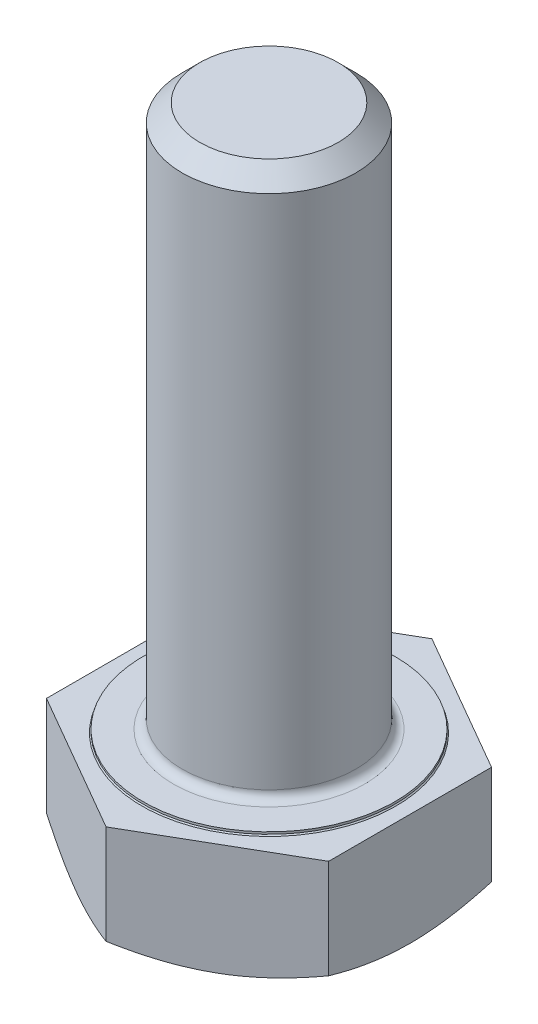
ISO-10303-21;
HEADER;
FILE_DESCRIPTION(('STEP AP214'),'2;1');
FILE_NAME('part.step','',(''),(''),'','','');
FILE_SCHEMA(('AUTOMOTIVE_DESIGN { 1 0 10303 214 1 1 1 1 }'));
ENDSEC;
DATA;
#1=APPLICATION_CONTEXT('core data for automotive mechanical design processes');
#2=APPLICATION_PROTOCOL_DEFINITION('international standard','automotive_design',2000,#1);
#3=PRODUCT_CONTEXT('',#1,'mechanical');
#4=PRODUCT('Part','Part','',(#3));
#5=PRODUCT_RELATED_PRODUCT_CATEGORY('part','',(#4));
#6=PRODUCT_DEFINITION_FORMATION('','',#4);
#7=PRODUCT_DEFINITION_CONTEXT('part definition',#1,'design');
#8=PRODUCT_DEFINITION('design','',#6,#7);
#9=PRODUCT_DEFINITION_SHAPE('','',#8);
#10=(LENGTH_UNIT() NAMED_UNIT(*) SI_UNIT(.MILLI.,.METRE.));
#11=(NAMED_UNIT(*) PLANE_ANGLE_UNIT() SI_UNIT($,.RADIAN.));
#12=(NAMED_UNIT(*) SI_UNIT($,.STERADIAN.) SOLID_ANGLE_UNIT());
#13=UNCERTAINTY_MEASURE_WITH_UNIT(LENGTH_MEASURE(1.E-05),#10,'distance_accuracy_value','');
#14=(GEOMETRIC_REPRESENTATION_CONTEXT(3) GLOBAL_UNCERTAINTY_ASSIGNED_CONTEXT((#13)) GLOBAL_UNIT_ASSIGNED_CONTEXT((#10,
#11,#12)) REPRESENTATION_CONTEXT('',''));
#15=CARTESIAN_POINT('',(0.,0.,0.));
#16=DIRECTION('',(0.,0.,1.));
#17=DIRECTION('',(1.,0.,0.));
#18=AXIS2_PLACEMENT_3D('',#15,#16,#17);
#19=CARTESIAN_POINT('',(0.,-5.3,0.));
#20=DIRECTION('',(0.,-1.,0.));
#21=DIRECTION('',(0.,0.,-1.));
#22=AXIS2_PLACEMENT_3D('',#19,#20,#21);
#23=PLANE('',#22);
#24=CARTESIAN_POINT('',(0.,-5.30000000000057,0.));
#25=DIRECTION('',(0.,1.,0.));
#26=DIRECTION('',(0.,0.,1.));
#27=AXIS2_PLACEMENT_3D('',#24,#25,#26);
#28=CIRCLE('',#27,6.50000000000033);
#29=CARTESIAN_POINT('',(-6.5,-5.30000000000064,2.32283677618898E-10));
#30=VERTEX_POINT('',#29);
#31=CARTESIAN_POINT('',(-3.25,-5.3000000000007,5.62916512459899));
#32=VERTEX_POINT('',#31);
#33=EDGE_CURVE('E174',#30,#32,#28,.T.);
#34=ORIENTED_EDGE('',*,*,#33,.F.);
#35=CARTESIAN_POINT('',(0.,-5.30000000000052,0.));
#36=DIRECTION('',(0.,1.,0.));
#37=DIRECTION('',(0.,0.,1.));
#38=AXIS2_PLACEMENT_3D('',#35,#36,#37);
#39=CIRCLE('',#38,6.50000000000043);
#40=CARTESIAN_POINT('',(-3.25000000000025,-5.30000000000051,-5.62916512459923));
#41=VERTEX_POINT('',#40);
#42=EDGE_CURVE('E59',#41,#30,#39,.T.);
#43=ORIENTED_EDGE('',*,*,#42,.F.);
#44=CARTESIAN_POINT('',(0.,-5.30000000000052,0.));
#45=DIRECTION('',(0.,1.,0.));
#46=DIRECTION('',(0.,0.,1.));
#47=AXIS2_PLACEMENT_3D('',#44,#45,#46);
#48=CIRCLE('',#47,6.50000000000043);
#49=CARTESIAN_POINT('',(3.25,-5.3000000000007,-5.62916512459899));
#50=VERTEX_POINT('',#49);
#51=EDGE_CURVE('E76',#50,#41,#48,.T.);
#52=ORIENTED_EDGE('',*,*,#51,.F.);
#53=CARTESIAN_POINT('',(0.,-5.30000000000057,0.));
#54=DIRECTION('',(0.,1.,0.));
#55=DIRECTION('',(0.,0.,1.));
#56=AXIS2_PLACEMENT_3D('',#53,#54,#55);
#57=CIRCLE('',#56,6.50000000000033);
#58=CARTESIAN_POINT('',(6.50000000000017,-5.30000000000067,-1.74207154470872E-10));
#59=VERTEX_POINT('',#58);
#60=EDGE_CURVE('E74',#59,#50,#57,.T.);
#61=ORIENTED_EDGE('',*,*,#60,.F.);
#62=CARTESIAN_POINT('',(0.,-5.30000000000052,0.));
#63=DIRECTION('',(0.,1.,0.));
#64=DIRECTION('',(0.,0.,1.));
#65=AXIS2_PLACEMENT_3D('',#62,#63,#64);
#66=CIRCLE('',#65,6.50000000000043);
#67=CARTESIAN_POINT('',(3.25000000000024,-5.30000000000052,5.62916512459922));
#68=VERTEX_POINT('',#67);
#69=EDGE_CURVE('E175',#68,#59,#66,.T.);
#70=ORIENTED_EDGE('',*,*,#69,.F.);
#71=CARTESIAN_POINT('',(0.,-5.30000000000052,0.));
#72=DIRECTION('',(0.,1.,0.));
#73=DIRECTION('',(0.,0.,1.));
#74=AXIS2_PLACEMENT_3D('',#71,#72,#73);
#75=CIRCLE('',#74,6.50000000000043);
#76=EDGE_CURVE('E170',#32,#68,#75,.T.);
#77=ORIENTED_EDGE('',*,*,#76,.F.);
#78=EDGE_LOOP('',(#34,#43,#52,#61,#70,#77));
#79=FACE_BOUND('',#78,.T.);
#80=ADVANCED_FACE('F42',(#79),#23,.T.);
#81=CARTESIAN_POINT('',(0.,-4.71596007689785,0.));
#82=DIRECTION('',(0.,1.,0.));
#83=DIRECTION('',(0.,0.,1.));
#84=AXIS2_PLACEMENT_3D('',#81,#82,#83);
#85=CONICAL_SURFACE('',#84,7.51158682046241,1.0471975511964);
#86=CARTESIAN_POINT('',(6.4999999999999,-4.71944341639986,-3.75277674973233));
#87=CARTESIAN_POINT('',(6.23545138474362,-4.80764841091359,-3.90551396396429));
#88=CARTESIAN_POINT('',(5.96878416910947,-4.88845958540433,-4.05947435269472));
#89=CARTESIAN_POINT('',(5.43309909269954,-5.0309686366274,-4.36875227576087));
#90=CARTESIAN_POINT('',(5.16409991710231,-5.09276102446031,-4.52405902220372));
#91=CARTESIAN_POINT('',(4.75806245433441,-5.16863158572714,-4.75848486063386));
#92=CARTESIAN_POINT('',(4.62220372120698,-5.1911279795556,-4.83692293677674));
#93=CARTESIAN_POINT('',(4.34983584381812,-5.23006970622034,-4.99417460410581));
#94=CARTESIAN_POINT('',(4.21332671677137,-5.24651519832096,-5.0729881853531));
#95=CARTESIAN_POINT('',(3.93915312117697,-5.27306617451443,-5.23128238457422));
#96=CARTESIAN_POINT('',(3.80148629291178,-5.28313941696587,-5.31076436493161));
#97=CARTESIAN_POINT('',(3.52588189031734,-5.29662027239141,-5.46988464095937));
#98=CARTESIAN_POINT('',(3.38794426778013,-5.30002656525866,-5.54952296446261));
#99=CARTESIAN_POINT('',(3.24999999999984,-5.30000000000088,-5.62916512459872));
#100=B_SPLINE_CURVE_WITH_KNOTS('',3,(#86,#87,#88,#89,#90,#91,#92,#93,#94,#95,#96,#97,#98,#99),
.UNSPECIFIED.,.F.,.F.,(4,2,2,2,2,2,4),(0.,0.954247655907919,1.90367376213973,2.37900973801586,
2.85433320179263,3.3320428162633,3.80984701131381),.UNSPECIFIED.);
#101=CARTESIAN_POINT('',(6.5,-4.71944341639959,-3.752776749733));
#102=VERTEX_POINT('',#101);
#103=EDGE_CURVE('E159',#102,#50,#100,.T.);
#104=ORIENTED_EDGE('',*,*,#103,.F.);
#105=CARTESIAN_POINT('',(6.5,-5.30000000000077,-3.48414706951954E-10));
#106=CARTESIAN_POINT('',(6.5,-5.30002656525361,-0.159284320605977));
#107=CARTESIAN_POINT('',(6.5,-5.29662027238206,-0.318560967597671));
#108=CARTESIAN_POINT('',(6.5,-5.28313941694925,-0.636801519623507));
#109=CARTESIAN_POINT('',(6.5,-5.27306617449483,-0.795765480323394));
#110=CARTESIAN_POINT('',(6.5,-5.24651519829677,-1.11235387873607));
#111=CARTESIAN_POINT('',(6.5,-5.23006970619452,-1.26998104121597));
#112=CARTESIAN_POINT('',(6.5,-5.19112797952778,-1.58448437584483));
#113=CARTESIAN_POINT('',(6.5,-5.16863158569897,-1.74136052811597));
#114=CARTESIAN_POINT('',(6.5,-5.09276102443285,-2.2102122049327));
#115=CARTESIAN_POINT('',(6.5,-5.0309686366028,-2.52082569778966));
#116=CARTESIAN_POINT('',(6.5,-4.88845958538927,-3.13938154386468));
#117=CARTESIAN_POINT('',(6.5,-4.80764841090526,-3.44730232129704));
#118=CARTESIAN_POINT('',(6.5,-4.71944341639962,-3.75277674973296));
#119=B_SPLINE_CURVE_WITH_KNOTS('',3,(#105,#106,#107,#108,#109,#110,#111,#112,#113,#114,#115,
#116,#117,#118),.UNSPECIFIED.,.F.,.F.,(4,2,2,2,2,2,4),(0.,0.477804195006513,0.955513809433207,
1.43083727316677,1.90617324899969,2.85559935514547,3.80984701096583),.UNSPECIFIED.);
#120=EDGE_CURVE('E309',#59,#102,#119,.T.);
#121=ORIENTED_EDGE('',*,*,#120,.F.);
#122=ORIENTED_EDGE('',*,*,#60,.T.);
#123=EDGE_LOOP('',(#104,#121,#122));
#124=FACE_BOUND('',#123,.T.);
#125=ADVANCED_FACE('F315',(#124),#85,.T.);
#126=CARTESIAN_POINT('',(0.,-4.71596007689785,0.));
#127=DIRECTION('',(0.,1.,0.));
#128=DIRECTION('',(0.,0.,1.));
#129=AXIS2_PLACEMENT_3D('',#126,#127,#128);
#130=CONICAL_SURFACE('',#129,7.51158682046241,1.0471975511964);
#131=CARTESIAN_POINT('',(6.5,-4.71944341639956,3.75277674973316));
#132=CARTESIAN_POINT('',(6.5,-4.80764841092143,3.4473023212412));
#133=CARTESIAN_POINT('',(6.5,-4.88845958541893,3.13938154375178));
#134=CARTESIAN_POINT('',(6.5,-5.03096863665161,2.52082569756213));
#135=CARTESIAN_POINT('',(6.5,-5.0927610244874,2.21021220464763));
#136=CARTESIAN_POINT('',(6.5,-5.16863158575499,1.74136052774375));
#137=CARTESIAN_POINT('',(6.5,-5.1911279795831,1.58448437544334));
#138=CARTESIAN_POINT('',(6.5,-5.23006970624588,1.26998104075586));
#139=CARTESIAN_POINT('',(6.5,-5.24651519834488,1.11235387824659));
#140=CARTESIAN_POINT('',(6.5,-5.27306617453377,0.795765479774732));
#141=CARTESIAN_POINT('',(6.5,-5.28313941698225,0.63680151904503));
#142=CARTESIAN_POINT('',(6.5,-5.29662027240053,0.318560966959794));
#143=CARTESIAN_POINT('',(6.5,-5.3000265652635,0.159284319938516));
#144=CARTESIAN_POINT('',(6.5,-5.30000000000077,-3.48414775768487E-10));
#145=B_SPLINE_CURVE_WITH_KNOTS('',3,(#131,#132,#133,#134,#135,#136,#137,#138,#139,#140,#141,
#142,#143,#144),.UNSPECIFIED.,.F.,.F.,(4,2,2,2,2,2,4),(0.,0.954247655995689,1.90367376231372,
2.37900973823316,2.85433320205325,3.332042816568,3.80984701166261),.UNSPECIFIED.);
#146=CARTESIAN_POINT('',(6.5,-4.71944341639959,3.752776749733));
#147=VERTEX_POINT('',#146);
#148=EDGE_CURVE('E269',#147,#59,#145,.T.);
#149=ORIENTED_EDGE('',*,*,#148,.F.);
#150=CARTESIAN_POINT('',(3.25000000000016,-5.30000000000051,5.62916512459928));
#151=CARTESIAN_POINT('',(3.38794426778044,-5.3000265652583,5.54952296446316));
#152=CARTESIAN_POINT('',(3.52588189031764,-5.29662027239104,5.46988464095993));
#153=CARTESIAN_POINT('',(3.80148629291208,-5.28313941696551,5.31076436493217));
#154=CARTESIAN_POINT('',(3.93915312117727,-5.27306617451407,5.23128238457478));
#155=CARTESIAN_POINT('',(4.21332671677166,-5.2465151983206,5.07298818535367));
#156=CARTESIAN_POINT('',(4.34983584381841,-5.23006970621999,4.99417460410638));
#157=CARTESIAN_POINT('',(4.62220372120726,-5.19112797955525,4.83692293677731));
#158=CARTESIAN_POINT('',(4.75806245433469,-5.16863158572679,4.75848486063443));
#159=CARTESIAN_POINT('',(5.16409991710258,-5.09276102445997,4.5240590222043));
#160=CARTESIAN_POINT('',(5.43309909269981,-5.03096863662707,4.36875227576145));
#161=CARTESIAN_POINT('',(5.96878416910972,-4.88845958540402,4.05947435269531));
#162=CARTESIAN_POINT('',(6.23545138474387,-4.80764841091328,3.90551396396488));
#163=CARTESIAN_POINT('',(6.50000000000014,-4.71944341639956,3.75277674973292));
#164=B_SPLINE_CURVE_WITH_KNOTS('',3,(#150,#151,#152,#153,#154,#155,#156,#157,#158,#159,#160,
#161,#162,#163),.UNSPECIFIED.,.F.,.F.,(4,2,2,2,2,2,4),(0.,0.477804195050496,0.955513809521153,
1.43083727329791,1.90617324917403,2.85559935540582,3.80984701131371),.UNSPECIFIED.);
#165=EDGE_CURVE('E244',#68,#147,#164,.T.);
#166=ORIENTED_EDGE('',*,*,#165,.F.);
#167=ORIENTED_EDGE('',*,*,#69,.T.);
#168=EDGE_LOOP('',(#149,#166,#167));
#169=FACE_BOUND('',#168,.T.);
#170=ADVANCED_FACE('F277',(#169),#130,.T.);
#171=CARTESIAN_POINT('',(0.,-4.715960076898,0.));
#172=DIRECTION('',(0.,1.,0.));
#173=DIRECTION('',(0.,0.,1.));
#174=AXIS2_PLACEMENT_3D('',#171,#172,#173);
#175=CONICAL_SURFACE('',#174,7.51158682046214,1.0471975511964);
#176=CARTESIAN_POINT('',(1.59653095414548E-13,-4.71944341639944,7.50555349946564));
#177=CARTESIAN_POINT('',(0.264548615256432,-4.80764841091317,7.35281628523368));
#178=CARTESIAN_POINT('',(0.531215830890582,-4.88845958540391,7.19885589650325));
#179=CARTESIAN_POINT('',(1.0669009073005,-5.03096863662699,6.88957797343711));
#180=CARTESIAN_POINT('',(1.33590008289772,-5.09276102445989,6.73427122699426));
#181=CARTESIAN_POINT('',(1.74193754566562,-5.16863158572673,6.49984538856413));
#182=CARTESIAN_POINT('',(1.87779627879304,-5.19112797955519,6.42140731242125));
#183=CARTESIAN_POINT('',(2.1501641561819,-5.23006970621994,6.26415564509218));
#184=CARTESIAN_POINT('',(2.28667328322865,-5.24651519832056,6.18534206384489));
#185=CARTESIAN_POINT('',(2.56084687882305,-5.27306617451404,6.02704786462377));
#186=CARTESIAN_POINT('',(2.69851370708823,-5.28313941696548,5.94756588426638));
#187=CARTESIAN_POINT('',(2.97411810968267,-5.29662027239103,5.78844560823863));
#188=CARTESIAN_POINT('',(3.11205573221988,-5.30002656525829,5.70880728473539));
#189=CARTESIAN_POINT('',(3.25000000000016,-5.30000000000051,5.62916512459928));
#190=B_SPLINE_CURVE_WITH_KNOTS('',3,(#176,#177,#178,#179,#180,#181,#182,#183,#184,#185,#186,
#187,#188,#189),.UNSPECIFIED.,.F.,.F.,(4,2,2,2,2,2,4),(0.,0.954247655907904,1.9036737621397,
2.37900973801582,2.85433320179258,3.33204281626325,3.80984701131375),.UNSPECIFIED.);
#191=CARTESIAN_POINT('',(3.05528172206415E-13,-4.71944341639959,7.50555349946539));
#192=VERTEX_POINT('',#191);
#193=EDGE_CURVE('E287',#192,#68,#190,.T.);
#194=ORIENTED_EDGE('',*,*,#193,.F.);
#195=CARTESIAN_POINT('',(-3.24999999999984,-5.30000000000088,5.62916512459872));
#196=CARTESIAN_POINT('',(-3.11205573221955,-5.30002656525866,5.70880728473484));
#197=CARTESIAN_POINT('',(-2.97411810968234,-5.2966202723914,5.78844560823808));
#198=CARTESIAN_POINT('',(-2.69851370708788,-5.28313941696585,5.94756588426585));
#199=CARTESIAN_POINT('',(-2.56084687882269,-5.2730661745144,6.02704786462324));
#200=CARTESIAN_POINT('',(-2.28667328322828,-5.24651519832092,6.18534206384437));
#201=CARTESIAN_POINT('',(-2.15016415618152,-5.23006970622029,6.26415564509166));
#202=CARTESIAN_POINT('',(-1.87779627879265,-5.19112797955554,6.42140731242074));
#203=CARTESIAN_POINT('',(-1.74193754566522,-5.16863158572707,6.49984538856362));
#204=CARTESIAN_POINT('',(-1.33590008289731,-5.09276102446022,6.73427122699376));
#205=CARTESIAN_POINT('',(-1.06690090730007,-5.0309686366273,6.88957797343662));
#206=CARTESIAN_POINT('',(-0.531215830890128,-4.8884595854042,7.19885589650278));
#207=CARTESIAN_POINT('',(-0.264548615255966,-4.80764841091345,7.35281628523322));
#208=CARTESIAN_POINT('',(3.19718971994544E-13,-4.71944341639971,7.50555349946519));
#209=B_SPLINE_CURVE_WITH_KNOTS('',3,(#195,#196,#197,#198,#199,#200,#201,#202,#203,#204,#205,
#206,#207,#208),.UNSPECIFIED.,.F.,.F.,(4,2,2,2,2,2,4),(0.,0.477804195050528,0.955513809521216,
1.43083727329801,1.90617324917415,2.855599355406,3.80984701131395),.UNSPECIFIED.);
#210=EDGE_CURVE('E243',#32,#192,#209,.T.);
#211=ORIENTED_EDGE('',*,*,#210,.F.);
#212=ORIENTED_EDGE('',*,*,#76,.T.);
#213=EDGE_LOOP('',(#194,#211,#212));
#214=FACE_BOUND('',#213,.T.);
#215=ADVANCED_FACE('F273',(#214),#175,.T.);
#216=CARTESIAN_POINT('',(0.,-4.71596007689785,0.));
#217=DIRECTION('',(0.,1.,0.));
#218=DIRECTION('',(0.,0.,1.));
#219=AXIS2_PLACEMENT_3D('',#216,#217,#218);
#220=CONICAL_SURFACE('',#219,7.51158682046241,1.0471975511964);
#221=CARTESIAN_POINT('',(-6.4999999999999,-4.71944341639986,3.75277674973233));
#222=CARTESIAN_POINT('',(-6.23545138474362,-4.80764841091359,3.90551396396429));
#223=CARTESIAN_POINT('',(-5.96878416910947,-4.88845958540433,4.05947435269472));
#224=CARTESIAN_POINT('',(-5.43309909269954,-5.0309686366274,4.36875227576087));
#225=CARTESIAN_POINT('',(-5.16409991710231,-5.09276102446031,4.52405902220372));
#226=CARTESIAN_POINT('',(-4.75806245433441,-5.16863158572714,4.75848486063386));
#227=CARTESIAN_POINT('',(-4.62220372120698,-5.1911279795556,4.83692293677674));
#228=CARTESIAN_POINT('',(-4.34983584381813,-5.23006970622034,4.99417460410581));
#229=CARTESIAN_POINT('',(-4.21332671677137,-5.24651519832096,5.0729881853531));
#230=CARTESIAN_POINT('',(-3.93915312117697,-5.27306617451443,5.23128238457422));
#231=CARTESIAN_POINT('',(-3.80148629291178,-5.28313941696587,5.31076436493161));
#232=CARTESIAN_POINT('',(-3.52588189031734,-5.29662027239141,5.46988464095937));
#233=CARTESIAN_POINT('',(-3.38794426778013,-5.30002656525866,5.54952296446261));
#234=CARTESIAN_POINT('',(-3.24999999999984,-5.30000000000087,5.62916512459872));
#235=B_SPLINE_CURVE_WITH_KNOTS('',3,(#221,#222,#223,#224,#225,#226,#227,#228,#229,#230,#231,
#232,#233,#234),.UNSPECIFIED.,.F.,.F.,(4,2,2,2,2,2,4),(0.,0.954247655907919,1.90367376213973,
2.37900973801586,2.85433320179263,3.3320428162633,3.80984701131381),.UNSPECIFIED.);
#236=CARTESIAN_POINT('',(-6.4999999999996,-4.71944341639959,3.75277674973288));
#237=VERTEX_POINT('',#236);
#238=EDGE_CURVE('E239',#237,#32,#235,.T.);
#239=ORIENTED_EDGE('',*,*,#238,.F.);
#240=CARTESIAN_POINT('',(-6.5,-5.30000000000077,4.64567355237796E-10));
#241=CARTESIAN_POINT('',(-6.5,-5.30002656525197,0.159284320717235));
#242=CARTESIAN_POINT('',(-6.5,-5.29662027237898,0.318560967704));
#243=CARTESIAN_POINT('',(-6.5,-5.28313941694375,0.636801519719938));
#244=CARTESIAN_POINT('',(-6.5,-5.27306617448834,0.795765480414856));
#245=CARTESIAN_POINT('',(-6.5,-5.24651519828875,1.11235387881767));
#246=CARTESIAN_POINT('',(-6.5,-5.23006970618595,1.26998104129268));
#247=CARTESIAN_POINT('',(-6.5,-5.19112797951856,1.58448437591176));
#248=CARTESIAN_POINT('',(-6.5,-5.16863158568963,1.74136052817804));
#249=CARTESIAN_POINT('',(-6.5,-5.09276102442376,2.21021220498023));
#250=CARTESIAN_POINT('',(-6.5,-5.03096863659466,2.5208256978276));
#251=CARTESIAN_POINT('',(-6.5,-4.88845958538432,3.13938154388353));
#252=CARTESIAN_POINT('',(-6.5,-4.80764841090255,3.44730232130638));
#253=CARTESIAN_POINT('',(-6.5,-4.71944341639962,3.75277674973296));
#254=B_SPLINE_CURVE_WITH_KNOTS('',3,(#240,#241,#242,#243,#244,#245,#246,#247,#248,#249,#250,
#251,#252,#253),.UNSPECIFIED.,.F.,.F.,(4,2,2,2,2,2,4),(0.,0.477804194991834,0.955513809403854,
1.430837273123,1.9061732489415,2.85559935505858,3.80984701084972),.UNSPECIFIED.);
#255=EDGE_CURVE('E250',#30,#237,#254,.T.);
#256=ORIENTED_EDGE('',*,*,#255,.F.);
#257=ORIENTED_EDGE('',*,*,#33,.T.);
#258=EDGE_LOOP('',(#239,#256,#257));
#259=FACE_BOUND('',#258,.T.);
#260=ADVANCED_FACE('F207',(#259),#220,.T.);
#261=CARTESIAN_POINT('',(0.,-4.715960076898,0.));
#262=DIRECTION('',(0.,1.,0.));
#263=DIRECTION('',(0.,0.,1.));
#264=AXIS2_PLACEMENT_3D('',#261,#262,#263);
#265=CONICAL_SURFACE('',#264,7.51158682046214,1.0471975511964);
#266=CARTESIAN_POINT('',(-2.03471728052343E-13,-4.71944341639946,-7.50555349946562));
#267=CARTESIAN_POINT('',(-0.264548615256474,-4.80764841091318,-7.35281628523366));
#268=CARTESIAN_POINT('',(-0.53121583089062,-4.88845958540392,-7.19885589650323));
#269=CARTESIAN_POINT('',(-1.06690090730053,-5.03096863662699,-6.88957797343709));
#270=CARTESIAN_POINT('',(-1.33590008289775,-5.0927610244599,-6.73427122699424));
#271=CARTESIAN_POINT('',(-1.74193754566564,-5.16863158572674,-6.49984538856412));
#272=CARTESIAN_POINT('',(-1.87779627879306,-5.19112797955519,-6.42140731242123));
#273=CARTESIAN_POINT('',(-2.15016415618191,-5.23006970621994,-6.26415564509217));
#274=CARTESIAN_POINT('',(-2.28667328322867,-5.24651519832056,-6.18534206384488));
#275=CARTESIAN_POINT('',(-2.56084687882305,-5.27306617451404,-6.02704786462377));
#276=CARTESIAN_POINT('',(-2.69851370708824,-5.28313941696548,-5.94756588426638));
#277=CARTESIAN_POINT('',(-2.97411810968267,-5.29662027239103,-5.78844560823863));
#278=CARTESIAN_POINT('',(-3.11205573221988,-5.30002656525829,-5.70880728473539));
#279=CARTESIAN_POINT('',(-3.25000000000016,-5.30000000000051,-5.62916512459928));
#280=B_SPLINE_CURVE_WITH_KNOTS('',3,(#266,#267,#268,#269,#270,#271,#272,#273,#274,#275,#276,
#277,#278,#279),.UNSPECIFIED.,.F.,.F.,(4,2,2,2,2,2,4),(0.,0.954247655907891,1.90367376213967,
2.37900973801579,2.85433320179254,3.3320428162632,3.80984701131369),.UNSPECIFIED.);
#281=CARTESIAN_POINT('',(2.4611389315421E-13,-4.71944341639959,-7.50555349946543));
#282=VERTEX_POINT('',#281);
#283=EDGE_CURVE('E196',#282,#41,#280,.T.);
#284=ORIENTED_EDGE('',*,*,#283,.F.);
#285=CARTESIAN_POINT('',(3.24999999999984,-5.30000000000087,-5.62916512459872));
#286=CARTESIAN_POINT('',(3.11205573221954,-5.30002656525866,-5.70880728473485));
#287=CARTESIAN_POINT('',(2.97411810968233,-5.2966202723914,-5.78844560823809));
#288=CARTESIAN_POINT('',(2.69851370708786,-5.28313941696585,-5.94756588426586));
#289=CARTESIAN_POINT('',(2.56084687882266,-5.2730661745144,-6.02704786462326));
#290=CARTESIAN_POINT('',(2.28667328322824,-5.24651519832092,-6.18534206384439));
#291=CARTESIAN_POINT('',(2.15016415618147,-5.23006970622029,-6.26415564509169));
#292=CARTESIAN_POINT('',(1.8777962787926,-5.19112797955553,-6.42140731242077));
#293=CARTESIAN_POINT('',(1.74193754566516,-5.16863158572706,-6.49984538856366));
#294=CARTESIAN_POINT('',(1.33590008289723,-5.0927610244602,-6.73427122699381));
#295=CARTESIAN_POINT('',(1.06690090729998,-5.03096863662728,-6.88957797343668));
#296=CARTESIAN_POINT('',(0.531215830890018,-4.88845958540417,-7.19885589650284));
#297=CARTESIAN_POINT('',(0.264548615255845,-4.80764841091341,-7.35281628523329));
#298=CARTESIAN_POINT('',(-4.51011908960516E-13,-4.71944341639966,-7.50555349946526));
#299=B_SPLINE_CURVE_WITH_KNOTS('',3,(#285,#286,#287,#288,#289,#290,#291,#292,#293,#294,#295,
#296,#297,#298),.UNSPECIFIED.,.F.,.F.,(4,2,2,2,2,2,4),(0.,0.477804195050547,0.955513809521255,
1.43083727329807,1.90617324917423,2.85559935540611,3.80984701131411),.UNSPECIFIED.);
#300=EDGE_CURVE('E144',#50,#282,#299,.T.);
#301=ORIENTED_EDGE('',*,*,#300,.F.);
#302=ORIENTED_EDGE('',*,*,#51,.T.);
#303=EDGE_LOOP('',(#284,#301,#302));
#304=FACE_BOUND('',#303,.T.);
#305=ADVANCED_FACE('F202',(#304),#265,.T.);
#306=CARTESIAN_POINT('',(0.,-4.71596007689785,0.));
#307=DIRECTION('',(0.,1.,0.));
#308=DIRECTION('',(0.,0.,1.));
#309=AXIS2_PLACEMENT_3D('',#306,#307,#308);
#310=CONICAL_SURFACE('',#309,7.51158682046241,1.0471975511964);
#311=CARTESIAN_POINT('',(-6.5,-4.71944341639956,-3.75277674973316));
#312=CARTESIAN_POINT('',(-6.5,-4.80764841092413,-3.44730232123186));
#313=CARTESIAN_POINT('',(-6.5,-4.88845958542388,-3.13938154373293));
#314=CARTESIAN_POINT('',(-6.5,-5.03096863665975,-2.52082569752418));
#315=CARTESIAN_POINT('',(-6.5,-5.09276102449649,-2.21021220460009));
#316=CARTESIAN_POINT('',(-6.5,-5.16863158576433,-1.74136052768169));
#317=CARTESIAN_POINT('',(-6.5,-5.19112797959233,-1.5844843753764));
#318=CARTESIAN_POINT('',(-6.5,-5.23006970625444,-1.26998104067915));
#319=CARTESIAN_POINT('',(-6.5,-5.2465151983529,-1.11235387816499));
#320=CARTESIAN_POINT('',(-6.5,-5.27306617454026,-0.79576547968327));
#321=CARTESIAN_POINT('',(-6.5,-5.28313941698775,-0.6368015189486));
#322=CARTESIAN_POINT('',(-6.5,-5.29662027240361,-0.318560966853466));
#323=CARTESIAN_POINT('',(-6.5,-5.30002656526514,-0.159284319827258));
#324=CARTESIAN_POINT('',(-6.5,-5.30000000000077,4.64566660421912E-10));
#325=B_SPLINE_CURVE_WITH_KNOTS('',3,(#311,#312,#313,#314,#315,#316,#317,#318,#319,#320,#321,
#322,#323,#324),.UNSPECIFIED.,.F.,.F.,(4,2,2,2,2,2,4),(0.,0.954247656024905,1.90367376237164,
2.3790097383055,2.85433320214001,3.33204281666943,3.80984701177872),.UNSPECIFIED.);
#326=CARTESIAN_POINT('',(-6.5,-4.71944341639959,-3.752776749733));
#327=VERTEX_POINT('',#326);
#328=EDGE_CURVE('E219',#327,#30,#325,.T.);
#329=ORIENTED_EDGE('',*,*,#328,.F.);
#330=CARTESIAN_POINT('',(-3.25000000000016,-5.30000000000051,-5.62916512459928));
#331=CARTESIAN_POINT('',(-3.38794426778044,-5.3000265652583,-5.54952296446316));
#332=CARTESIAN_POINT('',(-3.52588189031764,-5.29662027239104,-5.46988464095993));
#333=CARTESIAN_POINT('',(-3.80148629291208,-5.28313941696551,-5.31076436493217));
#334=CARTESIAN_POINT('',(-3.93915312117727,-5.27306617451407,-5.23128238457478));
#335=CARTESIAN_POINT('',(-4.21332671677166,-5.2465151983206,-5.07298818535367));
#336=CARTESIAN_POINT('',(-4.34983584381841,-5.23006970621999,-4.99417460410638));
#337=CARTESIAN_POINT('',(-4.62220372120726,-5.19112797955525,-4.83692293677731));
#338=CARTESIAN_POINT('',(-4.75806245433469,-5.16863158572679,-4.75848486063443));
#339=CARTESIAN_POINT('',(-5.16409991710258,-5.09276102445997,-4.5240590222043));
#340=CARTESIAN_POINT('',(-5.43309909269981,-5.03096863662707,-4.36875227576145));
#341=CARTESIAN_POINT('',(-5.96878416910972,-4.88845958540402,-4.05947435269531));
#342=CARTESIAN_POINT('',(-6.23545138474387,-4.80764841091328,-3.90551396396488));
#343=CARTESIAN_POINT('',(-6.50000000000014,-4.71944341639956,-3.75277674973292));
#344=B_SPLINE_CURVE_WITH_KNOTS('',3,(#330,#331,#332,#333,#334,#335,#336,#337,#338,#339,#340,
#341,#342,#343),.UNSPECIFIED.,.F.,.F.,(4,2,2,2,2,2,4),(0.,0.477804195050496,0.955513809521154,
1.43083727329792,1.90617324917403,2.85559935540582,3.80984701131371),.UNSPECIFIED.);
#345=EDGE_CURVE('E238',#41,#327,#344,.T.);
#346=ORIENTED_EDGE('',*,*,#345,.F.);
#347=ORIENTED_EDGE('',*,*,#42,.T.);
#348=EDGE_LOOP('',(#329,#346,#347));
#349=FACE_BOUND('',#348,.T.);
#350=ADVANCED_FACE('F206',(#349),#310,.T.);
#351=CARTESIAN_POINT('',(0.,0.,-7.505553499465));
#352=DIRECTION('',(0.500000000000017,0.,-0.866025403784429));
#353=DIRECTION('',(-0.866025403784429,0.,-0.500000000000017));
#354=AXIS2_PLACEMENT_3D('',#351,#352,#353);
#355=PLANE('',#354);
#356=ORIENTED_EDGE('',*,*,#300,.T.);
#357=DIRECTION('',(0.,-1.,0.));
#358=VECTOR('',#357,1.);
#359=CARTESIAN_POINT('',(2.4611389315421E-13,-0.15,-7.50555349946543));
#360=LINE('',#359,#358);
#361=CARTESIAN_POINT('',(2.4611389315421E-13,-0.15,-7.50555349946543));
#362=VERTEX_POINT('',#361);
#363=EDGE_CURVE('E140',#362,#282,#360,.T.);
#364=ORIENTED_EDGE('',*,*,#363,.F.);
#365=DIRECTION('',(-0.866025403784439,0.,-0.5));
#366=VECTOR('',#365,1.);
#367=CARTESIAN_POINT('',(2.4611389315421E-13,-0.15,-7.50555349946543));
#368=LINE('',#367,#366);
#369=CARTESIAN_POINT('',(6.5,-0.15,-3.752776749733));
#370=VERTEX_POINT('',#369);
#371=EDGE_CURVE('E129',#370,#362,#368,.T.);
#372=ORIENTED_EDGE('',*,*,#371,.F.);
#373=DIRECTION('',(0.,-1.,0.));
#374=VECTOR('',#373,1.);
#375=CARTESIAN_POINT('',(6.5,-0.15,-3.752776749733));
#376=LINE('',#375,#374);
#377=EDGE_CURVE('E148',#370,#102,#376,.T.);
#378=ORIENTED_EDGE('',*,*,#377,.T.);
#379=ORIENTED_EDGE('',*,*,#103,.T.);
#380=EDGE_LOOP('',(#356,#364,#372,#378,#379));
#381=FACE_BOUND('',#380,.T.);
#382=ADVANCED_FACE('F141',(#381),#355,.T.);
#383=CARTESIAN_POINT('',(6.5,0.,-3.752776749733));
#384=DIRECTION('',(1.,0.,0.));
#385=DIRECTION('',(0.,0.,-1.));
#386=AXIS2_PLACEMENT_3D('',#383,#384,#385);
#387=PLANE('',#386);
#388=ORIENTED_EDGE('',*,*,#120,.T.);
#389=ORIENTED_EDGE('',*,*,#377,.F.);
#390=DIRECTION('',(0.,0.,-1.));
#391=VECTOR('',#390,1.);
#392=CARTESIAN_POINT('',(6.5,-0.15,-3.752776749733));
#393=LINE('',#392,#391);
#394=CARTESIAN_POINT('',(6.5,-0.15,3.752776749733));
#395=VERTEX_POINT('',#394);
#396=EDGE_CURVE('E135',#395,#370,#393,.T.);
#397=ORIENTED_EDGE('',*,*,#396,.F.);
#398=DIRECTION('',(0.,-1.,0.));
#399=VECTOR('',#398,1.);
#400=CARTESIAN_POINT('',(6.5,-0.15,3.752776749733));
#401=LINE('',#400,#399);
#402=EDGE_CURVE('E703',#395,#147,#401,.T.);
#403=ORIENTED_EDGE('',*,*,#402,.T.);
#404=ORIENTED_EDGE('',*,*,#148,.T.);
#405=EDGE_LOOP('',(#388,#389,#397,#403,#404));
#406=FACE_BOUND('',#405,.T.);
#407=ADVANCED_FACE('F313',(#406),#387,.T.);
#408=CARTESIAN_POINT('',(6.5,0.,3.752776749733));
#409=DIRECTION('',(0.500000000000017,0.,0.866025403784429));
#410=DIRECTION('',(0.866025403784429,0.,-0.500000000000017));
#411=AXIS2_PLACEMENT_3D('',#408,#409,#410);
#412=PLANE('',#411);
#413=ORIENTED_EDGE('',*,*,#165,.T.);
#414=ORIENTED_EDGE('',*,*,#402,.F.);
#415=DIRECTION('',(0.866025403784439,0.,-0.5));
#416=VECTOR('',#415,1.);
#417=CARTESIAN_POINT('',(6.5,-0.15,3.752776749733));
#418=LINE('',#417,#416);
#419=CARTESIAN_POINT('',(3.05528172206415E-13,-0.15,7.50555349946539));
#420=VERTEX_POINT('',#419);
#421=EDGE_CURVE('E122',#420,#395,#418,.T.);
#422=ORIENTED_EDGE('',*,*,#421,.F.);
#423=DIRECTION('',(0.,-1.,0.));
#424=VECTOR('',#423,1.);
#425=CARTESIAN_POINT('',(3.05528172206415E-13,-0.15,7.50555349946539));
#426=LINE('',#425,#424);
#427=EDGE_CURVE('E183',#420,#192,#426,.T.);
#428=ORIENTED_EDGE('',*,*,#427,.T.);
#429=ORIENTED_EDGE('',*,*,#193,.T.);
#430=EDGE_LOOP('',(#413,#414,#422,#428,#429));
#431=FACE_BOUND('',#430,.T.);
#432=ADVANCED_FACE('F258',(#431),#412,.T.);
#433=CARTESIAN_POINT('',(0.,0.,7.505553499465));
#434=DIRECTION('',(-0.500000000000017,0.,0.866025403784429));
#435=DIRECTION('',(0.866025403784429,0.,0.500000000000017));
#436=AXIS2_PLACEMENT_3D('',#433,#434,#435);
#437=PLANE('',#436);
#438=ORIENTED_EDGE('',*,*,#210,.T.);
#439=ORIENTED_EDGE('',*,*,#427,.F.);
#440=DIRECTION('',(0.866025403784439,0.,0.5));
#441=VECTOR('',#440,1.);
#442=CARTESIAN_POINT('',(3.05528172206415E-13,-0.15,7.50555349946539));
#443=LINE('',#442,#441);
#444=CARTESIAN_POINT('',(-6.4999999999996,-0.15,3.75277674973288));
#445=VERTEX_POINT('',#444);
#446=EDGE_CURVE('E717',#445,#420,#443,.T.);
#447=ORIENTED_EDGE('',*,*,#446,.F.);
#448=DIRECTION('',(0.,-1.,0.));
#449=VECTOR('',#448,1.);
#450=CARTESIAN_POINT('',(-6.4999999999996,-0.15,3.75277674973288));
#451=LINE('',#450,#449);
#452=EDGE_CURVE('E114',#445,#237,#451,.T.);
#453=ORIENTED_EDGE('',*,*,#452,.T.);
#454=ORIENTED_EDGE('',*,*,#238,.T.);
#455=EDGE_LOOP('',(#438,#439,#447,#453,#454));
#456=FACE_BOUND('',#455,.T.);
#457=ADVANCED_FACE('F254',(#456),#437,.T.);
#458=CARTESIAN_POINT('',(-6.5,0.,3.752776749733));
#459=DIRECTION('',(-1.,0.,0.));
#460=DIRECTION('',(0.,0.,1.));
#461=AXIS2_PLACEMENT_3D('',#458,#459,#460);
#462=PLANE('',#461);
#463=ORIENTED_EDGE('',*,*,#255,.T.);
#464=ORIENTED_EDGE('',*,*,#452,.F.);
#465=DIRECTION('',(0.,0.,1.));
#466=VECTOR('',#465,1.);
#467=CARTESIAN_POINT('',(-6.4999999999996,-0.15,3.75277674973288));
#468=LINE('',#467,#466);
#469=CARTESIAN_POINT('',(-6.4999999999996,-0.15,-3.75277674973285));
#470=VERTEX_POINT('',#469);
#471=EDGE_CURVE('E91',#470,#445,#468,.T.);
#472=ORIENTED_EDGE('',*,*,#471,.F.);
#473=DIRECTION('',(0.,-1.,0.));
#474=VECTOR('',#473,1.);
#475=CARTESIAN_POINT('',(-6.4999999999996,-0.15,-3.75277674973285));
#476=LINE('',#475,#474);
#477=EDGE_CURVE('E83',#470,#327,#476,.T.);
#478=ORIENTED_EDGE('',*,*,#477,.T.);
#479=ORIENTED_EDGE('',*,*,#328,.T.);
#480=EDGE_LOOP('',(#463,#464,#472,#478,#479));
#481=FACE_BOUND('',#480,.T.);
#482=ADVANCED_FACE('F227',(#481),#462,.T.);
#483=CARTESIAN_POINT('',(-6.5,0.,-3.752776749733));
#484=DIRECTION('',(-0.500000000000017,0.,-0.866025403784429));
#485=DIRECTION('',(-0.866025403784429,0.,0.500000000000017));
#486=AXIS2_PLACEMENT_3D('',#483,#484,#485);
#487=PLANE('',#486);
#488=ORIENTED_EDGE('',*,*,#345,.T.);
#489=ORIENTED_EDGE('',*,*,#477,.F.);
#490=DIRECTION('',(-0.866025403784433,0.,0.50000000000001));
#491=VECTOR('',#490,1.);
#492=CARTESIAN_POINT('',(-6.4999999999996,-0.15,-3.75277674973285));
#493=LINE('',#492,#491);
#494=EDGE_CURVE('E133',#362,#470,#493,.T.);
#495=ORIENTED_EDGE('',*,*,#494,.F.);
#496=ORIENTED_EDGE('',*,*,#363,.T.);
#497=ORIENTED_EDGE('',*,*,#283,.T.);
#498=EDGE_LOOP('',(#488,#489,#495,#496,#497));
#499=FACE_BOUND('',#498,.T.);
#500=ADVANCED_FACE('F151',(#499),#487,.T.);
#501=CARTESIAN_POINT('',(0.,-0.15,0.));
#502=DIRECTION('',(0.,-1.,0.));
#503=DIRECTION('',(0.,0.,-1.));
#504=AXIS2_PLACEMENT_3D('',#501,#502,#503);
#505=PLANE('',#504);
#506=CARTESIAN_POINT('',(0.,-0.15,0.));
#507=DIRECTION('',(0.,-1.,0.));
#508=DIRECTION('',(0.,0.,-1.));
#509=AXIS2_PLACEMENT_3D('',#506,#507,#508);
#510=CIRCLE('',#509,5.85000000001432);
#511=CARTESIAN_POINT('',(0.,-0.15,-5.85000000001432));
#512=VERTEX_POINT('',#511);
#513=EDGE_CURVE('E487',#512,#512,#510,.T.);
#514=ORIENTED_EDGE('',*,*,#513,.T.);
#515=EDGE_LOOP('',(#514));
#516=FACE_BOUND('',#515,.T.);
#517=ORIENTED_EDGE('',*,*,#446,.T.);
#518=ORIENTED_EDGE('',*,*,#421,.T.);
#519=ORIENTED_EDGE('',*,*,#396,.T.);
#520=ORIENTED_EDGE('',*,*,#371,.T.);
#521=ORIENTED_EDGE('',*,*,#494,.T.);
#522=ORIENTED_EDGE('',*,*,#471,.T.);
#523=EDGE_LOOP('',(#517,#518,#519,#520,#521,#522));
#524=FACE_BOUND('',#523,.T.);
#525=ADVANCED_FACE('F131',(#516,#524),#505,.F.);
#526=CARTESIAN_POINT('',(0.,25.,0.));
#527=DIRECTION('',(0.,-1.,0.));
#528=DIRECTION('',(0.,0.,-1.));
#529=AXIS2_PLACEMENT_3D('',#526,#527,#528);
#530=CYLINDRICAL_SURFACE('',#529,4.);
#531=CARTESIAN_POINT('',(0.,0.400000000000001,0.));
#532=DIRECTION('',(0.,1.,0.));
#533=DIRECTION('',(0.,0.,1.));
#534=AXIS2_PLACEMENT_3D('',#531,#532,#533);
#535=CIRCLE('',#534,4.);
#536=CARTESIAN_POINT('',(0.,0.400000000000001,4.));
#537=VERTEX_POINT('',#536);
#538=EDGE_CURVE('E13',#537,#537,#535,.T.);
#539=ORIENTED_EDGE('',*,*,#538,.T.);
#540=EDGE_LOOP('',(#539));
#541=FACE_BOUND('',#540,.T.);
#542=CARTESIAN_POINT('',(0.,24.1881249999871,0.));
#543=DIRECTION('',(0.,1.,0.));
#544=DIRECTION('',(0.,0.,1.));
#545=AXIS2_PLACEMENT_3D('',#542,#543,#544);
#546=CIRCLE('',#545,4.);
#547=CARTESIAN_POINT('',(0.,24.1881249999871,4.));
#548=VERTEX_POINT('',#547);
#549=EDGE_CURVE('E477',#548,#548,#546,.F.);
#550=ORIENTED_EDGE('',*,*,#549,.T.);
#551=EDGE_LOOP('',(#550));
#552=FACE_BOUND('',#551,.T.);
#553=ADVANCED_FACE('F512',(#541,#552),#530,.T.);
#554=CARTESIAN_POINT('',(4.,25.,0.));
#555=DIRECTION('',(0.,1.,0.));
#556=DIRECTION('',(0.,0.,1.));
#557=AXIS2_PLACEMENT_3D('',#554,#555,#556);
#558=PLANE('',#557);
#559=CARTESIAN_POINT('',(0.,25.,0.));
#560=DIRECTION('',(0.,1.,0.));
#561=DIRECTION('',(0.,0.,1.));
#562=AXIS2_PLACEMENT_3D('',#559,#560,#561);
#563=CIRCLE('',#562,3.18812499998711);
#564=CARTESIAN_POINT('',(0.,25.,3.18812499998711));
#565=VERTEX_POINT('',#564);
#566=EDGE_CURVE('E482',#565,#565,#563,.T.);
#567=ORIENTED_EDGE('',*,*,#566,.T.);
#568=EDGE_LOOP('',(#567));
#569=FACE_BOUND('',#568,.T.);
#570=ADVANCED_FACE('F514',(#569),#558,.T.);
#571=CARTESIAN_POINT('',(0.,25.,0.));
#572=DIRECTION('',(0.,-1.,0.));
#573=DIRECTION('',(0.,0.,-1.));
#574=AXIS2_PLACEMENT_3D('',#571,#572,#573);
#575=CYLINDRICAL_SURFACE('',#574,5.8);
#576=CARTESIAN_POINT('',(0.,-0.099999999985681,0.));
#577=DIRECTION('',(0.,-1.,0.));
#578=DIRECTION('',(0.,0.,-1.));
#579=AXIS2_PLACEMENT_3D('',#576,#577,#578);
#580=CIRCLE('',#579,5.8);
#581=CARTESIAN_POINT('',(0.,-0.099999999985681,-5.8));
#582=VERTEX_POINT('',#581);
#583=EDGE_CURVE('E494',#582,#582,#580,.F.);
#584=ORIENTED_EDGE('',*,*,#583,.T.);
#585=EDGE_LOOP('',(#584));
#586=FACE_BOUND('',#585,.T.);
#587=CARTESIAN_POINT('',(0.,0.,0.));
#588=DIRECTION('',(0.,-1.,0.));
#589=DIRECTION('',(0.,0.,-1.));
#590=AXIS2_PLACEMENT_3D('',#587,#588,#589);
#591=CIRCLE('',#590,5.8);
#592=CARTESIAN_POINT('',(0.,0.,-5.8));
#593=VERTEX_POINT('',#592);
#594=EDGE_CURVE('E718',#593,#593,#591,.T.);
#595=ORIENTED_EDGE('',*,*,#594,.T.);
#596=EDGE_LOOP('',(#595));
#597=FACE_BOUND('',#596,.T.);
#598=ADVANCED_FACE('F519',(#586,#597),#575,.T.);
#599=CARTESIAN_POINT('',(5.8,0.,0.));
#600=DIRECTION('',(0.,1.,0.));
#601=DIRECTION('',(0.,0.,1.));
#602=AXIS2_PLACEMENT_3D('',#599,#600,#601);
#603=PLANE('',#602);
#604=CARTESIAN_POINT('',(0.,0.,0.));
#605=DIRECTION('',(0.,1.,0.));
#606=DIRECTION('',(0.,0.,1.));
#607=AXIS2_PLACEMENT_3D('',#604,#605,#606);
#608=CIRCLE('',#607,4.4);
#609=CARTESIAN_POINT('',(0.,0.,4.4));
#610=VERTEX_POINT('',#609);
#611=EDGE_CURVE('E51',#610,#610,#608,.F.);
#612=ORIENTED_EDGE('',*,*,#611,.T.);
#613=EDGE_LOOP('',(#612));
#614=FACE_BOUND('',#613,.T.);
#615=ORIENTED_EDGE('',*,*,#594,.F.);
#616=EDGE_LOOP('',(#615));
#617=FACE_BOUND('',#616,.T.);
#618=ADVANCED_FACE('F499',(#614,#617),#603,.T.);
#619=CARTESIAN_POINT('',(0.,24.1881249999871,0.));
#620=DIRECTION('',(0.,-1.,0.));
#621=DIRECTION('',(0.,0.,-1.));
#622=AXIS2_PLACEMENT_3D('',#619,#620,#621);
#623=CONICAL_SURFACE('',#622,4.,0.78539816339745);
#624=ORIENTED_EDGE('',*,*,#566,.F.);
#625=EDGE_LOOP('',(#624));
#626=FACE_BOUND('',#625,.T.);
#627=ORIENTED_EDGE('',*,*,#549,.F.);
#628=EDGE_LOOP('',(#627));
#629=FACE_BOUND('',#628,.T.);
#630=ADVANCED_FACE('F508',(#626,#629),#623,.T.);
#631=CARTESIAN_POINT('',(0.,-0.150000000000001,0.));
#632=DIRECTION('',(0.,-1.,0.));
#633=DIRECTION('',(0.,0.,-1.));
#634=AXIS2_PLACEMENT_3D('',#631,#632,#633);
#635=CONICAL_SURFACE('',#634,5.85000000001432,0.785398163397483);
#636=ORIENTED_EDGE('',*,*,#583,.F.);
#637=EDGE_LOOP('',(#636));
#638=FACE_BOUND('',#637,.T.);
#639=ORIENTED_EDGE('',*,*,#513,.F.);
#640=EDGE_LOOP('',(#639));
#641=FACE_BOUND('',#640,.T.);
#642=ADVANCED_FACE('F503',(#638,#641),#635,.T.);
#643=CARTESIAN_POINT('',(0.,0.400000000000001,0.));
#644=DIRECTION('',(0.,1.,0.));
#645=DIRECTION('',(0.,0.,1.));
#646=AXIS2_PLACEMENT_3D('',#643,#644,#645);
#647=TOROIDAL_SURFACE('',#646,4.4,0.4);
#648=ORIENTED_EDGE('',*,*,#538,.F.);
#649=EDGE_LOOP('',(#648));
#650=FACE_BOUND('',#649,.T.);
#651=ORIENTED_EDGE('',*,*,#611,.F.);
#652=EDGE_LOOP('',(#651));
#653=FACE_BOUND('',#652,.T.);
#654=ADVANCED_FACE('F44',(#650,#653),#647,.F.);
#655=CLOSED_SHELL('',(#80,#125,#170,#215,#260,#305,#350,#382,#407,#432,#457,#482,#500,#525,#553,
#570,#598,#618,#630,#642,#654));
#656=MANIFOLD_SOLID_BREP('B2',#655);
#657=ADVANCED_BREP_SHAPE_REPRESENTATION('',(#18,#656),#14);
#658=SHAPE_DEFINITION_REPRESENTATION(#9,#657);
ENDSEC;
END-ISO-10303-21;
